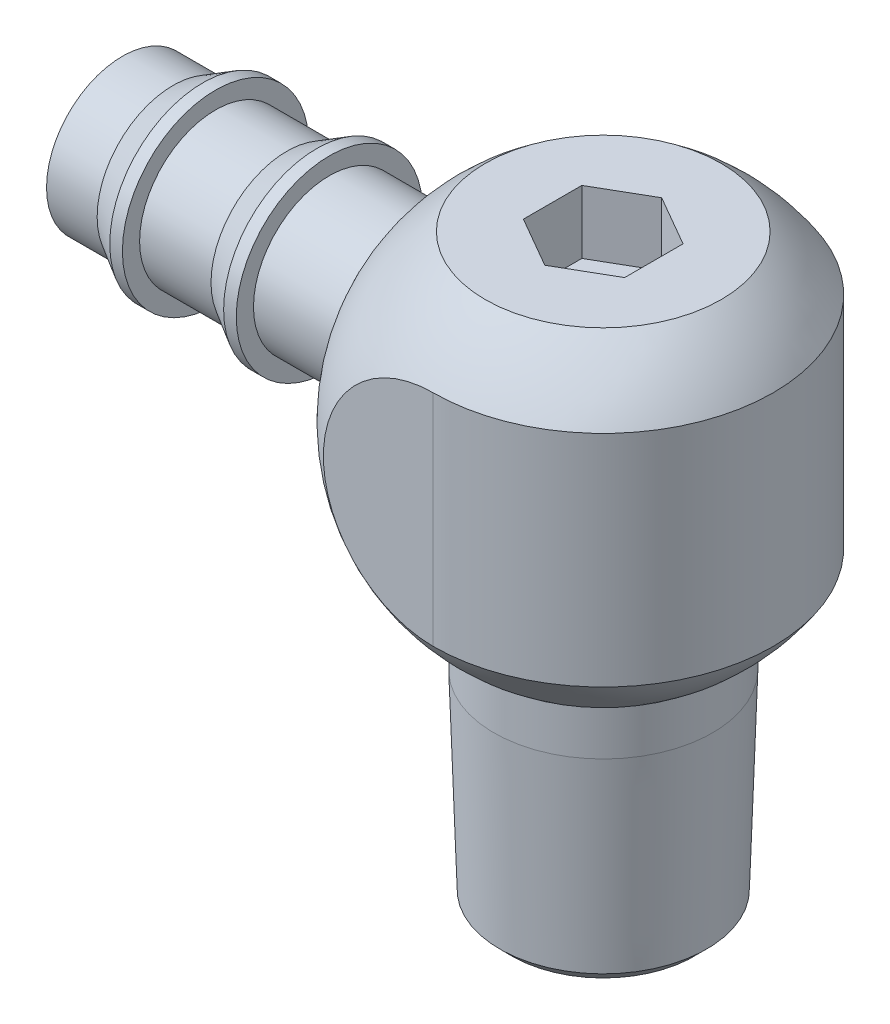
ISO-10303-21;
HEADER;
FILE_DESCRIPTION(('STEP AP214'),'2;1');
FILE_NAME('part.step','',(''),(''),'','','');
FILE_SCHEMA(('AUTOMOTIVE_DESIGN { 1 0 10303 214 1 1 1 1 }'));
ENDSEC;
DATA;
#1=APPLICATION_CONTEXT('core data for automotive mechanical design processes');
#2=APPLICATION_PROTOCOL_DEFINITION('international standard','automotive_design',2000,#1);
#3=PRODUCT_CONTEXT('',#1,'mechanical');
#4=PRODUCT('Part','Part','',(#3));
#5=PRODUCT_RELATED_PRODUCT_CATEGORY('part','',(#4));
#6=PRODUCT_DEFINITION_FORMATION('','',#4);
#7=PRODUCT_DEFINITION_CONTEXT('part definition',#1,'design');
#8=PRODUCT_DEFINITION('design','',#6,#7);
#9=PRODUCT_DEFINITION_SHAPE('','',#8);
#10=(LENGTH_UNIT() NAMED_UNIT(*) SI_UNIT(.MILLI.,.METRE.));
#11=(NAMED_UNIT(*) PLANE_ANGLE_UNIT() SI_UNIT($,.RADIAN.));
#12=(NAMED_UNIT(*) SI_UNIT($,.STERADIAN.) SOLID_ANGLE_UNIT());
#13=UNCERTAINTY_MEASURE_WITH_UNIT(LENGTH_MEASURE(1.E-05),#10,'distance_accuracy_value','');
#14=(GEOMETRIC_REPRESENTATION_CONTEXT(3) GLOBAL_UNCERTAINTY_ASSIGNED_CONTEXT((#13)) GLOBAL_UNIT_ASSIGNED_CONTEXT((#10,
#11,#12)) REPRESENTATION_CONTEXT('',''));
#15=CARTESIAN_POINT('',(0.,0.,0.));
#16=DIRECTION('',(0.,0.,1.));
#17=DIRECTION('',(1.,0.,0.));
#18=AXIS2_PLACEMENT_3D('',#15,#16,#17);
#19=CARTESIAN_POINT('',(-19.05,5.6642,-10.668));
#20=DIRECTION('',(0.,-1.,0.));
#21=DIRECTION('',(1.,0.,0.));
#22=AXIS2_PLACEMENT_3D('',#19,#20,#21);
#23=PLANE('',#22);
#24=CARTESIAN_POINT('',(0.,5.6642,0.));
#25=DIRECTION('',(0.,-1.,0.));
#26=DIRECTION('',(1.,0.,0.));
#27=AXIS2_PLACEMENT_3D('',#24,#25,#26);
#28=CIRCLE('',#27,7.40360712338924);
#29=CARTESIAN_POINT('',(7.40360712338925,5.6642,0.));
#30=VERTEX_POINT('',#29);
#31=EDGE_CURVE('E206',#30,#30,#28,.F.);
#32=ORIENTED_EDGE('',*,*,#31,.F.);
#33=EDGE_LOOP('',(#32));
#34=FACE_BOUND('',#33,.T.);
#35=CARTESIAN_POINT('',(0.,5.66419999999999,0.));
#36=DIRECTION('',(0.,1.,0.));
#37=DIRECTION('',(-1.,0.,0.));
#38=AXIS2_PLACEMENT_3D('',#35,#36,#37);
#39=CIRCLE('',#38,6.85799999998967);
#40=CARTESIAN_POINT('',(-6.85799999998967,5.66419999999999,0.));
#41=VERTEX_POINT('',#40);
#42=EDGE_CURVE('E167',#41,#41,#39,.T.);
#43=ORIENTED_EDGE('',*,*,#42,.T.);
#44=EDGE_LOOP('',(#43));
#45=FACE_BOUND('',#44,.T.);
#46=ADVANCED_FACE('F38',(#34,#45),#23,.T.);
#47=CARTESIAN_POINT('',(-10.668,3.28295,10.668));
#48=DIRECTION('',(1.,0.,0.));
#49=DIRECTION('',(0.,0.,-1.));
#50=AXIS2_PLACEMENT_3D('',#47,#48,#49);
#51=PLANE('',#50);
#52=CARTESIAN_POINT('',(-10.668,15.98295,0.));
#53=DIRECTION('',(1.,0.,0.));
#54=DIRECTION('',(0.,0.,-1.));
#55=AXIS2_PLACEMENT_3D('',#52,#53,#54);
#56=CIRCLE('',#55,5.953125);
#57=CARTESIAN_POINT('',(-10.668,15.98295,-5.953125));
#58=VERTEX_POINT('',#57);
#59=EDGE_CURVE('E12',#58,#58,#56,.T.);
#60=ORIENTED_EDGE('',*,*,#59,.T.);
#61=EDGE_LOOP('',(#60));
#62=FACE_BOUND('',#61,.T.);
#63=CARTESIAN_POINT('',(-10.668,15.98295,0.));
#64=DIRECTION('',(1.,0.,0.));
#65=DIRECTION('',(0.,0.,-1.));
#66=AXIS2_PLACEMENT_3D('',#63,#64,#65);
#67=CIRCLE('',#66,6.89084726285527);
#68=CARTESIAN_POINT('',(-10.668,15.98295,-6.89084726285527));
#69=VERTEX_POINT('',#68);
#70=EDGE_CURVE('E212',#69,#69,#67,.F.);
#71=ORIENTED_EDGE('',*,*,#70,.T.);
#72=EDGE_LOOP('',(#71));
#73=FACE_BOUND('',#72,.T.);
#74=ADVANCED_FACE('F247',(#62,#73),#51,.F.);
#75=CARTESIAN_POINT('',(0.,15.98295,0.));
#76=DIRECTION('',(0.,-1.,0.));
#77=DIRECTION('',(1.,0.,0.));
#78=AXIS2_PLACEMENT_3D('',#75,#76,#77);
#79=SPHERICAL_SURFACE('',#78,12.7);
#80=ORIENTED_EDGE('',*,*,#31,.T.);
#81=EDGE_LOOP('',(#80));
#82=FACE_BOUND('',#81,.T.);
#83=ORIENTED_EDGE('',*,*,#70,.F.);
#84=EDGE_LOOP('',(#83));
#85=FACE_BOUND('',#84,.T.);
#86=CARTESIAN_POINT('',(0.,15.98295,-10.668));
#87=DIRECTION('',(0.,0.,1.));
#88=DIRECTION('',(1.,0.,0.));
#89=AXIS2_PLACEMENT_3D('',#86,#87,#88);
#90=CIRCLE('',#89,6.89084726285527);
#91=CARTESIAN_POINT('',(0.,9.09210273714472,-10.668));
#92=VERTEX_POINT('',#91);
#93=CARTESIAN_POINT('',(0.,22.8737972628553,-10.668));
#94=VERTEX_POINT('',#93);
#95=EDGE_CURVE('E219',#92,#94,#90,.F.);
#96=ORIENTED_EDGE('',*,*,#95,.F.);
#97=CARTESIAN_POINT('',(0.,9.09210273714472,0.));
#98=DIRECTION('',(0.,1.,0.));
#99=DIRECTION('',(0.,0.,1.));
#100=AXIS2_PLACEMENT_3D('',#97,#98,#99);
#101=CIRCLE('',#100,10.668);
#102=CARTESIAN_POINT('',(0.,9.09210273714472,10.668));
#103=VERTEX_POINT('',#102);
#104=EDGE_CURVE('E217',#103,#92,#101,.T.);
#105=ORIENTED_EDGE('',*,*,#104,.F.);
#106=CARTESIAN_POINT('',(0.,15.98295,10.668));
#107=DIRECTION('',(0.,0.,-1.));
#108=DIRECTION('',(-1.,0.,0.));
#109=AXIS2_PLACEMENT_3D('',#106,#107,#108);
#110=CIRCLE('',#109,6.89084726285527);
#111=CARTESIAN_POINT('',(0.,22.8737972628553,10.668));
#112=VERTEX_POINT('',#111);
#113=EDGE_CURVE('E213',#112,#103,#110,.F.);
#114=ORIENTED_EDGE('',*,*,#113,.F.);
#115=CARTESIAN_POINT('',(0.,22.8737972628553,0.));
#116=DIRECTION('',(0.,-1.,0.));
#117=DIRECTION('',(0.,0.,-1.));
#118=AXIS2_PLACEMENT_3D('',#115,#116,#117);
#119=CIRCLE('',#118,10.668);
#120=EDGE_CURVE('E215',#94,#112,#119,.T.);
#121=ORIENTED_EDGE('',*,*,#120,.F.);
#122=EDGE_LOOP('',(#96,#105,#114,#121));
#123=FACE_BOUND('',#122,.T.);
#124=CARTESIAN_POINT('',(0.,26.3017,0.));
#125=DIRECTION('',(0.,1.,0.));
#126=DIRECTION('',(-1.,0.,0.));
#127=AXIS2_PLACEMENT_3D('',#124,#125,#126);
#128=CIRCLE('',#127,7.40360712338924);
#129=CARTESIAN_POINT('',(-7.40360712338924,26.3017,0.));
#130=VERTEX_POINT('',#129);
#131=EDGE_CURVE('E209',#130,#130,#128,.F.);
#132=ORIENTED_EDGE('',*,*,#131,.T.);
#133=EDGE_LOOP('',(#132));
#134=FACE_BOUND('',#133,.T.);
#135=ADVANCED_FACE('F253',(#82,#85,#123,#134),#79,.T.);
#136=CARTESIAN_POINT('',(0.,3.28295,-10.668));
#137=DIRECTION('',(0.,0.,1.));
#138=DIRECTION('',(1.,0.,0.));
#139=AXIS2_PLACEMENT_3D('',#136,#137,#138);
#140=PLANE('',#139);
#141=ORIENTED_EDGE('',*,*,#95,.T.);
#142=DIRECTION('',(0.,-1.,0.));
#143=VECTOR('',#142,1.);
#144=CARTESIAN_POINT('',(0.,3.28295,-10.668));
#145=LINE('',#144,#143);
#146=EDGE_CURVE('E208',#94,#92,#145,.T.);
#147=ORIENTED_EDGE('',*,*,#146,.T.);
#148=EDGE_LOOP('',(#141,#147));
#149=FACE_BOUND('',#148,.T.);
#150=ADVANCED_FACE('F265',(#149),#140,.F.);
#151=CARTESIAN_POINT('',(0.,3.28295,10.668));
#152=DIRECTION('',(0.,0.,-1.));
#153=DIRECTION('',(-1.,0.,0.));
#154=AXIS2_PLACEMENT_3D('',#151,#152,#153);
#155=PLANE('',#154);
#156=ORIENTED_EDGE('',*,*,#113,.T.);
#157=DIRECTION('',(0.,-1.,0.));
#158=VECTOR('',#157,1.);
#159=CARTESIAN_POINT('',(0.,3.28295,10.668));
#160=LINE('',#159,#158);
#161=EDGE_CURVE('E60',#112,#103,#160,.T.);
#162=ORIENTED_EDGE('',*,*,#161,.F.);
#163=EDGE_LOOP('',(#156,#162));
#164=FACE_BOUND('',#163,.T.);
#165=ADVANCED_FACE('F262',(#164),#155,.F.);
#166=CARTESIAN_POINT('',(0.,3.28295,0.));
#167=DIRECTION('',(0.,-1.,0.));
#168=DIRECTION('',(0.,0.,-1.));
#169=AXIS2_PLACEMENT_3D('',#166,#167,#168);
#170=CYLINDRICAL_SURFACE('',#169,10.668);
#171=ORIENTED_EDGE('',*,*,#104,.T.);
#172=ORIENTED_EDGE('',*,*,#146,.F.);
#173=ORIENTED_EDGE('',*,*,#120,.T.);
#174=ORIENTED_EDGE('',*,*,#161,.T.);
#175=EDGE_LOOP('',(#171,#172,#173,#174));
#176=FACE_BOUND('',#175,.T.);
#177=ADVANCED_FACE('F264',(#176),#170,.T.);
#178=CARTESIAN_POINT('',(-19.05,26.3017,-10.668));
#179=DIRECTION('',(0.,1.,0.));
#180=DIRECTION('',(-1.,0.,0.));
#181=AXIS2_PLACEMENT_3D('',#178,#179,#180);
#182=PLANE('',#181);
#183=DIRECTION('',(0.,0.,-1.));
#184=VECTOR('',#183,1.);
#185=CARTESIAN_POINT('',(3.175,26.3017,1.83308710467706));
#186=LINE('',#185,#184);
#187=CARTESIAN_POINT('',(3.175,26.3017,1.83308710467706));
#188=VERTEX_POINT('',#187);
#189=CARTESIAN_POINT('',(3.175,26.3017,-1.83308710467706));
#190=VERTEX_POINT('',#189);
#191=EDGE_CURVE('E53',#188,#190,#186,.T.);
#192=ORIENTED_EDGE('',*,*,#191,.F.);
#193=DIRECTION('',(0.866025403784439,0.,-0.5));
#194=VECTOR('',#193,1.);
#195=CARTESIAN_POINT('',(0.,26.3017,3.66617420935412));
#196=LINE('',#195,#194);
#197=CARTESIAN_POINT('',(0.,26.3017,3.66617420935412));
#198=VERTEX_POINT('',#197);
#199=EDGE_CURVE('E124',#198,#188,#196,.T.);
#200=ORIENTED_EDGE('',*,*,#199,.F.);
#201=DIRECTION('',(0.866025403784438,0.,0.5));
#202=VECTOR('',#201,1.);
#203=CARTESIAN_POINT('',(-3.175,26.3017,1.83308710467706));
#204=LINE('',#203,#202);
#205=CARTESIAN_POINT('',(-3.175,26.3017,1.83308710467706));
#206=VERTEX_POINT('',#205);
#207=EDGE_CURVE('E127',#206,#198,#204,.T.);
#208=ORIENTED_EDGE('',*,*,#207,.F.);
#209=DIRECTION('',(0.,0.,1.));
#210=VECTOR('',#209,1.);
#211=CARTESIAN_POINT('',(-3.175,26.3017,-1.83308710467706));
#212=LINE('',#211,#210);
#213=CARTESIAN_POINT('',(-3.175,26.3017,-1.83308710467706));
#214=VERTEX_POINT('',#213);
#215=EDGE_CURVE('E150',#214,#206,#212,.T.);
#216=ORIENTED_EDGE('',*,*,#215,.F.);
#217=DIRECTION('',(-0.866025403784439,0.,0.5));
#218=VECTOR('',#217,1.);
#219=CARTESIAN_POINT('',(0.,26.3017,-3.66617420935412));
#220=LINE('',#219,#218);
#221=CARTESIAN_POINT('',(0.,26.3017,-3.66617420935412));
#222=VERTEX_POINT('',#221);
#223=EDGE_CURVE('E147',#222,#214,#220,.T.);
#224=ORIENTED_EDGE('',*,*,#223,.F.);
#225=DIRECTION('',(-0.866025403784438,0.,-0.5));
#226=VECTOR('',#225,1.);
#227=CARTESIAN_POINT('',(3.175,26.3017,-1.83308710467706));
#228=LINE('',#227,#226);
#229=EDGE_CURVE('E145',#190,#222,#228,.T.);
#230=ORIENTED_EDGE('',*,*,#229,.F.);
#231=EDGE_LOOP('',(#192,#200,#208,#216,#224,#230));
#232=FACE_BOUND('',#231,.T.);
#233=ORIENTED_EDGE('',*,*,#131,.F.);
#234=EDGE_LOOP('',(#233));
#235=FACE_BOUND('',#234,.T.);
#236=ADVANCED_FACE('F260',(#232,#235),#182,.T.);
#237=CARTESIAN_POINT('',(0.,15.98295,0.));
#238=DIRECTION('',(-1.,0.,0.));
#239=DIRECTION('',(0.,0.,1.));
#240=AXIS2_PLACEMENT_3D('',#237,#238,#239);
#241=CYLINDRICAL_SURFACE('',#240,4.7625);
#242=CARTESIAN_POINT('',(-11.858625,15.98295,0.));
#243=DIRECTION('',(1.,0.,0.));
#244=DIRECTION('',(0.,0.,-1.));
#245=AXIS2_PLACEMENT_3D('',#242,#243,#244);
#246=CIRCLE('',#245,4.7625);
#247=CARTESIAN_POINT('',(-11.858625,15.98295,-4.7625));
#248=VERTEX_POINT('',#247);
#249=EDGE_CURVE('E46',#248,#248,#246,.F.);
#250=ORIENTED_EDGE('',*,*,#249,.T.);
#251=EDGE_LOOP('',(#250));
#252=FACE_BOUND('',#251,.T.);
#253=CARTESIAN_POINT('',(-17.1802511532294,15.98295,0.));
#254=DIRECTION('',(-1.,0.,0.));
#255=DIRECTION('',(0.,0.,1.));
#256=AXIS2_PLACEMENT_3D('',#253,#254,#255);
#257=CIRCLE('',#256,4.7625);
#258=CARTESIAN_POINT('',(-17.1802511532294,15.98295,4.7625));
#259=VERTEX_POINT('',#258);
#260=EDGE_CURVE('E182',#259,#259,#257,.T.);
#261=ORIENTED_EDGE('',*,*,#260,.F.);
#262=EDGE_LOOP('',(#261));
#263=FACE_BOUND('',#262,.T.);
#264=ADVANCED_FACE('F229',(#252,#263),#241,.T.);
#265=CARTESIAN_POINT('',(0.,15.98295,0.));
#266=DIRECTION('',(-1.,0.,0.));
#267=DIRECTION('',(0.,0.,1.));
#268=AXIS2_PLACEMENT_3D('',#265,#266,#267);
#269=CYLINDRICAL_SURFACE('',#268,4.7625);
#270=CARTESIAN_POINT('',(-30.1625,15.98295,0.));
#271=DIRECTION('',(-1.,0.,0.));
#272=DIRECTION('',(0.,0.,1.));
#273=AXIS2_PLACEMENT_3D('',#270,#271,#272);
#274=CIRCLE('',#273,4.7625);
#275=CARTESIAN_POINT('',(-30.1625,15.98295,4.7625));
#276=VERTEX_POINT('',#275);
#277=EDGE_CURVE('E179',#276,#276,#274,.T.);
#278=ORIENTED_EDGE('',*,*,#277,.F.);
#279=EDGE_LOOP('',(#278));
#280=FACE_BOUND('',#279,.T.);
#281=CARTESIAN_POINT('',(-26.9875,15.98295,0.));
#282=DIRECTION('',(-1.,0.,0.));
#283=DIRECTION('',(0.,0.,1.));
#284=AXIS2_PLACEMENT_3D('',#281,#282,#283);
#285=CIRCLE('',#284,4.7625);
#286=CARTESIAN_POINT('',(-26.9875,15.98295,4.7625));
#287=VERTEX_POINT('',#286);
#288=EDGE_CURVE('E203',#287,#287,#285,.T.);
#289=ORIENTED_EDGE('',*,*,#288,.T.);
#290=EDGE_LOOP('',(#289));
#291=FACE_BOUND('',#290,.T.);
#292=ADVANCED_FACE('F290',(#280,#291),#269,.T.);
#293=CARTESIAN_POINT('',(-25.1177511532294,15.98295,0.));
#294=DIRECTION('',(1.,0.,0.));
#295=DIRECTION('',(0.,0.,-1.));
#296=AXIS2_PLACEMENT_3D('',#293,#294,#295);
#297=CONICAL_SURFACE('',#296,5.842,0.523598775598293);
#298=ORIENTED_EDGE('',*,*,#288,.F.);
#299=EDGE_LOOP('',(#298));
#300=FACE_BOUND('',#299,.T.);
#301=CARTESIAN_POINT('',(-25.1177511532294,15.98295,0.));
#302=DIRECTION('',(-1.,0.,0.));
#303=DIRECTION('',(0.,0.,1.));
#304=AXIS2_PLACEMENT_3D('',#301,#302,#303);
#305=CIRCLE('',#304,5.842);
#306=CARTESIAN_POINT('',(-25.1177511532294,15.98295,5.842));
#307=VERTEX_POINT('',#306);
#308=EDGE_CURVE('E200',#307,#307,#305,.T.);
#309=ORIENTED_EDGE('',*,*,#308,.T.);
#310=EDGE_LOOP('',(#309));
#311=FACE_BOUND('',#310,.T.);
#312=ADVANCED_FACE('F360',(#300,#311),#297,.T.);
#313=CARTESIAN_POINT('',(0.,15.98295,0.));
#314=DIRECTION('',(-1.,0.,0.));
#315=DIRECTION('',(0.,0.,1.));
#316=AXIS2_PLACEMENT_3D('',#313,#314,#315);
#317=CYLINDRICAL_SURFACE('',#316,5.842);
#318=ORIENTED_EDGE('',*,*,#308,.F.);
#319=EDGE_LOOP('',(#318));
#320=FACE_BOUND('',#319,.T.);
#321=CARTESIAN_POINT('',(-24.3240011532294,15.98295,0.));
#322=DIRECTION('',(-1.,0.,0.));
#323=DIRECTION('',(0.,0.,1.));
#324=AXIS2_PLACEMENT_3D('',#321,#322,#323);
#325=CIRCLE('',#324,5.842);
#326=CARTESIAN_POINT('',(-24.3240011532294,15.98295,5.842));
#327=VERTEX_POINT('',#326);
#328=EDGE_CURVE('E197',#327,#327,#325,.T.);
#329=ORIENTED_EDGE('',*,*,#328,.T.);
#330=EDGE_LOOP('',(#329));
#331=FACE_BOUND('',#330,.T.);
#332=ADVANCED_FACE('F356',(#320,#331),#317,.T.);
#333=CARTESIAN_POINT('',(-24.3240011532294,15.98295,-5.842));
#334=DIRECTION('',(-1.,0.,0.));
#335=DIRECTION('',(0.,0.,1.));
#336=AXIS2_PLACEMENT_3D('',#333,#334,#335);
#337=PLANE('',#336);
#338=ORIENTED_EDGE('',*,*,#328,.F.);
#339=EDGE_LOOP('',(#338));
#340=FACE_BOUND('',#339,.T.);
#341=CARTESIAN_POINT('',(-24.3240011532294,15.98295,0.));
#342=DIRECTION('',(-1.,0.,0.));
#343=DIRECTION('',(0.,0.,1.));
#344=AXIS2_PLACEMENT_3D('',#341,#342,#343);
#345=CIRCLE('',#344,4.7625);
#346=CARTESIAN_POINT('',(-24.3240011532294,15.98295,4.7625));
#347=VERTEX_POINT('',#346);
#348=EDGE_CURVE('E194',#347,#347,#345,.T.);
#349=ORIENTED_EDGE('',*,*,#348,.T.);
#350=EDGE_LOOP('',(#349));
#351=FACE_BOUND('',#350,.T.);
#352=ADVANCED_FACE('F352',(#340,#351),#337,.F.);
#353=CARTESIAN_POINT('',(0.,15.98295,0.));
#354=DIRECTION('',(-1.,0.,0.));
#355=DIRECTION('',(0.,0.,1.));
#356=AXIS2_PLACEMENT_3D('',#353,#354,#355);
#357=CYLINDRICAL_SURFACE('',#356,4.7625);
#358=ORIENTED_EDGE('',*,*,#348,.F.);
#359=EDGE_LOOP('',(#358));
#360=FACE_BOUND('',#359,.T.);
#361=CARTESIAN_POINT('',(-19.84375,15.98295,0.));
#362=DIRECTION('',(-1.,0.,0.));
#363=DIRECTION('',(0.,0.,1.));
#364=AXIS2_PLACEMENT_3D('',#361,#362,#363);
#365=CIRCLE('',#364,4.7625);
#366=CARTESIAN_POINT('',(-19.84375,15.98295,4.7625));
#367=VERTEX_POINT('',#366);
#368=EDGE_CURVE('E191',#367,#367,#365,.T.);
#369=ORIENTED_EDGE('',*,*,#368,.T.);
#370=EDGE_LOOP('',(#369));
#371=FACE_BOUND('',#370,.T.);
#372=ADVANCED_FACE('F348',(#360,#371),#357,.T.);
#373=CARTESIAN_POINT('',(-17.9740011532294,15.98295,0.));
#374=DIRECTION('',(1.,0.,0.));
#375=DIRECTION('',(0.,0.,-1.));
#376=AXIS2_PLACEMENT_3D('',#373,#374,#375);
#377=CONICAL_SURFACE('',#376,5.842,0.523598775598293);
#378=ORIENTED_EDGE('',*,*,#368,.F.);
#379=EDGE_LOOP('',(#378));
#380=FACE_BOUND('',#379,.T.);
#381=CARTESIAN_POINT('',(-17.9740011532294,15.98295,0.));
#382=DIRECTION('',(-1.,0.,0.));
#383=DIRECTION('',(0.,0.,1.));
#384=AXIS2_PLACEMENT_3D('',#381,#382,#383);
#385=CIRCLE('',#384,5.842);
#386=CARTESIAN_POINT('',(-17.9740011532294,15.98295,5.842));
#387=VERTEX_POINT('',#386);
#388=EDGE_CURVE('E188',#387,#387,#385,.T.);
#389=ORIENTED_EDGE('',*,*,#388,.T.);
#390=EDGE_LOOP('',(#389));
#391=FACE_BOUND('',#390,.T.);
#392=ADVANCED_FACE('F344',(#380,#391),#377,.T.);
#393=CARTESIAN_POINT('',(0.,15.98295,0.));
#394=DIRECTION('',(-1.,0.,0.));
#395=DIRECTION('',(0.,0.,1.));
#396=AXIS2_PLACEMENT_3D('',#393,#394,#395);
#397=CYLINDRICAL_SURFACE('',#396,5.842);
#398=ORIENTED_EDGE('',*,*,#388,.F.);
#399=EDGE_LOOP('',(#398));
#400=FACE_BOUND('',#399,.T.);
#401=CARTESIAN_POINT('',(-17.1802511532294,15.98295,0.));
#402=DIRECTION('',(-1.,0.,0.));
#403=DIRECTION('',(0.,0.,1.));
#404=AXIS2_PLACEMENT_3D('',#401,#402,#403);
#405=CIRCLE('',#404,5.842);
#406=CARTESIAN_POINT('',(-17.1802511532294,15.98295,5.842));
#407=VERTEX_POINT('',#406);
#408=EDGE_CURVE('E185',#407,#407,#405,.T.);
#409=ORIENTED_EDGE('',*,*,#408,.T.);
#410=EDGE_LOOP('',(#409));
#411=FACE_BOUND('',#410,.T.);
#412=ADVANCED_FACE('F340',(#400,#411),#397,.T.);
#413=CARTESIAN_POINT('',(-17.1802511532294,15.98295,-5.842));
#414=DIRECTION('',(-1.,0.,0.));
#415=DIRECTION('',(0.,0.,1.));
#416=AXIS2_PLACEMENT_3D('',#413,#414,#415);
#417=PLANE('',#416);
#418=ORIENTED_EDGE('',*,*,#408,.F.);
#419=EDGE_LOOP('',(#418));
#420=FACE_BOUND('',#419,.T.);
#421=ORIENTED_EDGE('',*,*,#260,.T.);
#422=EDGE_LOOP('',(#421));
#423=FACE_BOUND('',#422,.T.);
#424=ADVANCED_FACE('F242',(#420,#423),#417,.F.);
#425=CARTESIAN_POINT('',(-30.1625,15.98295,0.));
#426=DIRECTION('',(1.,0.,0.));
#427=DIRECTION('',(0.,0.,-1.));
#428=AXIS2_PLACEMENT_3D('',#425,#426,#427);
#429=PLANE('',#428);
#430=CARTESIAN_POINT('',(-30.1625,15.98295,0.));
#431=DIRECTION('',(-1.,0.,0.));
#432=DIRECTION('',(0.,0.,1.));
#433=AXIS2_PLACEMENT_3D('',#430,#431,#432);
#434=CIRCLE('',#433,3.4925);
#435=CARTESIAN_POINT('',(-30.1625,15.98295,3.4925));
#436=VERTEX_POINT('',#435);
#437=EDGE_CURVE('E176',#436,#436,#434,.T.);
#438=ORIENTED_EDGE('',*,*,#437,.F.);
#439=EDGE_LOOP('',(#438));
#440=FACE_BOUND('',#439,.T.);
#441=ORIENTED_EDGE('',*,*,#277,.T.);
#442=EDGE_LOOP('',(#441));
#443=FACE_BOUND('',#442,.T.);
#444=ADVANCED_FACE('F234',(#440,#443),#429,.F.);
#445=CARTESIAN_POINT('',(-11.858625,15.98295,0.));
#446=DIRECTION('',(1.,0.,0.));
#447=DIRECTION('',(0.,0.,-1.));
#448=AXIS2_PLACEMENT_3D('',#445,#446,#447);
#449=TOROIDAL_SURFACE('',#448,5.953125,1.190625);
#450=ORIENTED_EDGE('',*,*,#59,.F.);
#451=EDGE_LOOP('',(#450));
#452=FACE_BOUND('',#451,.T.);
#453=ORIENTED_EDGE('',*,*,#249,.F.);
#454=EDGE_LOOP('',(#453));
#455=FACE_BOUND('',#454,.T.);
#456=ADVANCED_FACE('F40',(#452,#455),#449,.F.);
#457=CARTESIAN_POINT('',(9.87828173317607,15.98295,0.));
#458=DIRECTION('',(-1.,0.,0.));
#459=DIRECTION('',(0.,0.,1.));
#460=AXIS2_PLACEMENT_3D('',#457,#458,#459);
#461=CYLINDRICAL_SURFACE('',#460,3.4925);
#462=CARTESIAN_POINT('',(-3.23787739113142,15.98295,3.4925));
#463=CARTESIAN_POINT('',(-3.23787574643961,15.9006540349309,3.49250095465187));
#464=CARTESIAN_POINT('',(-3.24103033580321,15.8183648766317,3.4895846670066));
#465=CARTESIAN_POINT('',(-3.25345666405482,15.6546240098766,3.47800197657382));
#466=CARTESIAN_POINT('',(-3.26273142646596,15.573172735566,3.46933273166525));
#467=CARTESIAN_POINT('',(-3.28690649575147,15.4117293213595,3.4464367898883));
#468=CARTESIAN_POINT('',(-3.30181917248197,15.3317407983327,3.43219787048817));
#469=CARTESIAN_POINT('',(-3.33652658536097,15.1739419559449,3.39846758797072));
#470=CARTESIAN_POINT('',(-3.35632424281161,15.0961329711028,3.37897308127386));
#471=CARTESIAN_POINT('',(-3.42118356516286,14.8686944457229,3.31370243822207));
#472=CARTESIAN_POINT('',(-3.47210346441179,14.7227311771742,3.26079327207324));
#473=CARTESIAN_POINT('',(-3.58341103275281,14.4422966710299,3.13806132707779));
#474=CARTESIAN_POINT('',(-3.64379804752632,14.3078246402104,3.06823971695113));
#475=CARTESIAN_POINT('',(-3.78139961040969,14.0250801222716,2.89770102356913));
#476=CARTESIAN_POINT('',(-3.85958419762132,13.8793156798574,2.79360655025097));
#477=CARTESIAN_POINT('',(-4.01569902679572,13.6049902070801,2.56414850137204));
#478=CARTESIAN_POINT('',(-4.09362876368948,13.4764533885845,2.43875554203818));
#479=CARTESIAN_POINT('',(-4.21312256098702,13.2867402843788,2.22250847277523));
#480=CARTESIAN_POINT('',(-4.25666537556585,13.2193208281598,2.13815073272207));
#481=CARTESIAN_POINT('',(-4.34045231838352,13.0919321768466,1.96248243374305));
#482=CARTESIAN_POINT('',(-4.38069795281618,13.0319595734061,1.87117508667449));
#483=CARTESIAN_POINT('',(-4.45672144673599,12.9202409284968,1.68208305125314));
#484=CARTESIAN_POINT('',(-4.49250579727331,12.8684829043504,1.58430809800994));
#485=CARTESIAN_POINT('',(-4.55856277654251,12.7739336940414,1.38280879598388));
#486=CARTESIAN_POINT('',(-4.58883813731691,12.7311380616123,1.27908742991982));
#487=CARTESIAN_POINT('',(-4.65414554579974,12.6394999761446,1.02198440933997));
#488=CARTESIAN_POINT('',(-4.68589117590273,12.5955855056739,0.865940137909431));
#489=CARTESIAN_POINT('',(-4.7337194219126,12.5297250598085,0.547057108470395));
#490=CARTESIAN_POINT('',(-4.7498153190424,12.5077604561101,0.384224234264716));
#491=CARTESIAN_POINT('',(-4.76501199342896,12.4870177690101,0.0558737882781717));
#492=CARTESIAN_POINT('',(-4.76407247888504,12.4882946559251,-0.109649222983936));
#493=CARTESIAN_POINT('',(-4.7451770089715,12.5140986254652,-0.437889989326));
#494=CARTESIAN_POINT('',(-4.72721678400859,12.5386315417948,-0.600607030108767));
#495=CARTESIAN_POINT('',(-4.67663048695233,12.6084016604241,-0.913758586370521));
#496=CARTESIAN_POINT('',(-4.64446581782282,12.652988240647,-1.06441595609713));
#497=CARTESIAN_POINT('',(-4.56796317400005,12.760549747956,-1.35566195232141));
#498=CARTESIAN_POINT('',(-4.52362267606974,12.8235284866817,-1.49624848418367));
#499=CARTESIAN_POINT('',(-4.42013192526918,12.9734671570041,-1.78020188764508));
#500=CARTESIAN_POINT('',(-4.35988897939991,13.0623032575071,-1.92217271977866));
#501=CARTESIAN_POINT('',(-4.23176072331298,13.2572665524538,-2.18990467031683));
#502=CARTESIAN_POINT('',(-4.16386826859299,13.3634099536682,-2.31565039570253));
#503=CARTESIAN_POINT('',(-4.01118991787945,13.6128511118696,-2.57257203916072));
#504=CARTESIAN_POINT('',(-3.92565795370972,13.7593716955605,-2.70017994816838));
#505=CARTESIAN_POINT('',(-3.75713602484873,14.0725322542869,-2.93012214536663));
#506=CARTESIAN_POINT('',(-3.67414665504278,14.2391768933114,-3.03245055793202));
#507=CARTESIAN_POINT('',(-3.53685230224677,14.5542998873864,-3.19070979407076));
#508=CARTESIAN_POINT('',(-3.48019979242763,14.6991102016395,-3.25187952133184));
#509=CARTESIAN_POINT('',(-3.38087443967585,14.9998667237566,-3.35503240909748));
#510=CARTESIAN_POINT('',(-3.33817016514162,15.155786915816,-3.39705879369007));
#511=CARTESIAN_POINT('',(-3.27911773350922,15.448551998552,-3.45401224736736));
#512=CARTESIAN_POINT('',(-3.25949455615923,15.5840498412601,-3.47236265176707));
#513=CARTESIAN_POINT('',(-3.23744512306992,15.8576123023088,-3.49293703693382));
#514=CARTESIAN_POINT('',(-3.23500237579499,15.9956743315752,-3.49517648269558));
#515=CARTESIAN_POINT('',(-3.24769267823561,16.2701175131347,-3.48338281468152));
#516=CARTESIAN_POINT('',(-3.26281055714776,16.4065000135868,-3.46936374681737));
#517=CARTESIAN_POINT('',(-3.30821474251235,16.6742873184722,-3.42608775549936));
#518=CARTESIAN_POINT('',(-3.33852508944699,16.8056838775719,-3.39680667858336));
#519=CARTESIAN_POINT('',(-3.42483095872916,17.1121389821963,-3.31013169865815));
#520=CARTESIAN_POINT('',(-3.48624709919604,17.2837922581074,-3.24618958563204));
#521=CARTESIAN_POINT('',(-3.62119007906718,17.611316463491,-3.09494294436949));
#522=CARTESIAN_POINT('',(-3.69474120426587,17.7671547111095,-3.0075913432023));
#523=CARTESIAN_POINT('',(-3.84843797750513,18.0670995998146,-2.80842873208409));
#524=CARTESIAN_POINT('',(-3.92871853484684,18.2106802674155,-2.69593234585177));
#525=CARTESIAN_POINT('',(-4.08698884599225,18.479218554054,-2.44936261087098));
#526=CARTESIAN_POINT('',(-4.16498031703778,18.6041904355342,-2.31530595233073));
#527=CARTESIAN_POINT('',(-4.31101468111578,18.8304477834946,-2.03016864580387));
#528=CARTESIAN_POINT('',(-4.37926095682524,18.9322571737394,-1.87961091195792));
#529=CARTESIAN_POINT('',(-4.50292722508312,19.1129410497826,-1.56020858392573));
#530=CARTESIAN_POINT('',(-4.55835000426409,19.1918205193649,-1.3913679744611));
#531=CARTESIAN_POINT('',(-4.62829990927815,19.2901892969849,-1.12639066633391));
#532=CARTESIAN_POINT('',(-4.64949140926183,19.319750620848,-1.03562899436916));
#533=CARTESIAN_POINT('',(-4.68678858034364,19.3715284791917,-0.851034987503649));
#534=CARTESIAN_POINT('',(-4.70289700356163,19.3937489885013,-0.757204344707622));
#535=CARTESIAN_POINT('',(-4.72955915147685,19.4304182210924,-0.567331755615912));
#536=CARTESIAN_POINT('',(-4.74011687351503,19.4448725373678,-0.471291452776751));
#537=CARTESIAN_POINT('',(-4.7553747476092,19.4657348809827,-0.277884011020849));
#538=CARTESIAN_POINT('',(-4.76007592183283,19.4721443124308,-0.180517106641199));
#539=CARTESIAN_POINT('',(-4.76322226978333,19.4764349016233,-0.000114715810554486));
#540=CARTESIAN_POINT('',(-4.76249924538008,19.4754499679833,0.0828822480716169));
#541=CARTESIAN_POINT('',(-4.75673542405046,19.4675861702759,0.248473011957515));
#542=CARTESIAN_POINT('',(-4.75169331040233,19.4607055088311,0.331066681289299));
#543=CARTESIAN_POINT('',(-4.73740392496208,19.4411563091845,0.495164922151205));
#544=CARTESIAN_POINT('',(-4.72815830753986,19.4284900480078,0.576669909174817));
#545=CARTESIAN_POINT('',(-4.70566945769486,19.3975634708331,0.738061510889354));
#546=CARTESIAN_POINT('',(-4.69242466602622,19.3793009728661,0.817947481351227));
#547=CARTESIAN_POINT('',(-4.64796968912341,19.3177037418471,1.04974765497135));
#548=CARTESIAN_POINT('',(-4.61157539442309,19.2669382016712,1.19877819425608));
#549=CARTESIAN_POINT('',(-4.5272787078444,19.1474697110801,1.48580198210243));
#550=CARTESIAN_POINT('',(-4.47937448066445,19.0787638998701,1.62379346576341));
#551=CARTESIAN_POINT('',(-4.36819246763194,18.9157427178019,1.90416795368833));
#552=CARTESIAN_POINT('',(-4.30372862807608,18.8192669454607,2.04482074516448));
#553=CARTESIAN_POINT('',(-4.16805500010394,18.60884120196,2.30885669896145));
#554=CARTESIAN_POINT('',(-4.09683673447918,18.4948691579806,2.43221766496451));
#555=CARTESIAN_POINT('',(-3.93818988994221,18.2277779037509,2.6829202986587));
#556=CARTESIAN_POINT('',(-3.85028357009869,18.0713477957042,2.80644275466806));
#557=CARTESIAN_POINT('',(-3.679958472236,17.7376167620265,3.02631644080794));
#558=CARTESIAN_POINT('',(-3.59753729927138,17.5603250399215,3.12267958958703));
#559=CARTESIAN_POINT('',(-3.47074274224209,17.2388777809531,3.2621443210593));
#560=CARTESIAN_POINT('',(-3.42220579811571,17.0995666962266,3.31260085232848));
#561=CARTESIAN_POINT('',(-3.33949406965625,16.8118888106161,3.39597870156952));
#562=CARTESIAN_POINT('',(-3.30527509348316,16.6635515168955,3.42895405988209));
#563=CARTESIAN_POINT('',(-3.26683604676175,16.4253931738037,3.46547921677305));
#564=CARTESIAN_POINT('',(-3.25604608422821,16.337586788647,3.47558051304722));
#565=CARTESIAN_POINT('',(-3.24156723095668,16.1608343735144,3.48909077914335));
#566=CARTESIAN_POINT('',(-3.23787916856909,16.0718882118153,3.49249896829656));
#567=CARTESIAN_POINT('',(-3.23787739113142,15.98295,3.4925));
#568=B_SPLINE_CURVE_WITH_KNOTS('',3,(#462,#463,#464,#465,#466,#467,#468,#469,#470,#471,#472,
#473,#474,#475,#476,#477,#478,#479,#480,#481,#482,#483,#484,#485,#486,#487,#488,#489,#490,#491,
#492,#493,#494,#495,#496,#497,#498,#499,#500,#501,#502,#503,#504,#505,#506,#507,#508,#509,#510,
#511,#512,#513,#514,#515,#516,#517,#518,#519,#520,#521,#522,#523,#524,#525,#526,#527,#528,#529,
#530,#531,#532,#533,#534,#535,#536,#537,#538,#539,#540,#541,#542,#543,#544,#545,#546,#547,#548,
#549,#550,#551,#552,#553,#554,#555,#556,#557,#558,#559,#560,#561,#562,#563,#564,#565,#566,#567),
.UNSPECIFIED.,.T.,.F.,(4,2,2,2,2,2,2,2,2,2,2,2,2,2,2,2,2,2,2,2,2,2,2,2,2,2,2,2,2,2,2,2,2,2,2,2,
2,2,2,2,2,2,2,2,2,2,2,2,2,2,2,2,4),(0.,0.246766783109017,0.493655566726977,0.741089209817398,
0.988671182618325,1.47678799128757,1.96487107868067,2.54920623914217,3.13435420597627,
3.48324329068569,3.83197209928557,4.18018744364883,4.52822962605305,5.0214971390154,
5.51434567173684,6.00836003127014,6.50249834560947,6.98164737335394,7.46089577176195,
7.99287476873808,8.52535480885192,9.15976130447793,9.79431511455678,10.2939861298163,
10.7925232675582,11.2050923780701,11.6172654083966,12.0290826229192,12.4415535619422,
13.0179778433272,13.5955700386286,14.1914045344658,14.7867799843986,15.3669326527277,
15.9469591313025,16.2399137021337,16.5327093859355,16.8252939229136,17.1178273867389,
17.3665304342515,17.6153093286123,17.86399039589,18.1127685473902,18.595407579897,
19.0781236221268,19.6231162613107,20.168802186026,20.8197105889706,21.4703328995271,
21.9366078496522,22.4014328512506,22.6680854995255,22.9347692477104),.UNSPECIFIED.);
#569=CARTESIAN_POINT('',(-3.23787739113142,15.98295,3.4925));
#570=VERTEX_POINT('',#569);
#571=EDGE_CURVE('E130',#570,#570,#568,.T.);
#572=ORIENTED_EDGE('',*,*,#571,.T.);
#573=EDGE_LOOP('',(#572));
#574=FACE_BOUND('',#573,.T.);
#575=ORIENTED_EDGE('',*,*,#437,.T.);
#576=EDGE_LOOP('',(#575));
#577=FACE_BOUND('',#576,.T.);
#578=ADVANCED_FACE('F233',(#574,#577),#461,.F.);
#579=CARTESIAN_POINT('',(0.,-10.2108,0.));
#580=DIRECTION('',(0.,1.,0.));
#581=DIRECTION('',(-1.,0.,0.));
#582=AXIS2_PLACEMENT_3D('',#579,#580,#581);
#583=CONICAL_SURFACE('',#582,5.72293971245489,0.785398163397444);
#584=CARTESIAN_POINT('',(0.,-9.44880000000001,0.));
#585=DIRECTION('',(0.,1.,0.));
#586=DIRECTION('',(-1.,0.,0.));
#587=AXIS2_PLACEMENT_3D('',#584,#585,#586);
#588=CIRCLE('',#587,6.48493971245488);
#589=CARTESIAN_POINT('',(-6.48493971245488,-9.44880000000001,0.));
#590=VERTEX_POINT('',#589);
#591=EDGE_CURVE('E173',#590,#590,#588,.T.);
#592=ORIENTED_EDGE('',*,*,#591,.F.);
#593=EDGE_LOOP('',(#592));
#594=FACE_BOUND('',#593,.T.);
#595=CARTESIAN_POINT('',(0.,-10.2108,0.));
#596=DIRECTION('',(0.,1.,0.));
#597=DIRECTION('',(-1.,0.,0.));
#598=AXIS2_PLACEMENT_3D('',#595,#596,#597);
#599=CIRCLE('',#598,5.72293971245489);
#600=CARTESIAN_POINT('',(-5.72293971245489,-10.2108,0.));
#601=VERTEX_POINT('',#600);
#602=EDGE_CURVE('E157',#601,#601,#599,.T.);
#603=ORIENTED_EDGE('',*,*,#602,.T.);
#604=EDGE_LOOP('',(#603));
#605=FACE_BOUND('',#604,.T.);
#606=ADVANCED_FACE('F240',(#594,#605),#583,.T.);
#607=CARTESIAN_POINT('',(0.,-9.44880000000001,0.));
#608=DIRECTION('',(0.,1.,0.));
#609=DIRECTION('',(-1.,0.,0.));
#610=AXIS2_PLACEMENT_3D('',#607,#608,#609);
#611=CONICAL_SURFACE('',#610,6.48493971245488,0.0312396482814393);
#612=CARTESIAN_POINT('',(0.,2.48919999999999,0.));
#613=DIRECTION('',(0.,1.,0.));
#614=DIRECTION('',(-1.,0.,0.));
#615=AXIS2_PLACEMENT_3D('',#612,#613,#614);
#616=CIRCLE('',#615,6.85799999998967);
#617=CARTESIAN_POINT('',(-6.85799999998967,2.48919999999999,0.));
#618=VERTEX_POINT('',#617);
#619=EDGE_CURVE('E170',#618,#618,#616,.T.);
#620=ORIENTED_EDGE('',*,*,#619,.F.);
#621=EDGE_LOOP('',(#620));
#622=FACE_BOUND('',#621,.T.);
#623=ORIENTED_EDGE('',*,*,#591,.T.);
#624=EDGE_LOOP('',(#623));
#625=FACE_BOUND('',#624,.T.);
#626=ADVANCED_FACE('F329',(#622,#625),#611,.T.);
#627=CARTESIAN_POINT('',(0.,-11.0195942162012,0.));
#628=DIRECTION('',(0.,1.,0.));
#629=DIRECTION('',(-1.,0.,0.));
#630=AXIS2_PLACEMENT_3D('',#627,#628,#629);
#631=CYLINDRICAL_SURFACE('',#630,6.85799999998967);
#632=ORIENTED_EDGE('',*,*,#42,.F.);
#633=EDGE_LOOP('',(#632));
#634=FACE_BOUND('',#633,.T.);
#635=ORIENTED_EDGE('',*,*,#619,.T.);
#636=EDGE_LOOP('',(#635));
#637=FACE_BOUND('',#636,.T.);
#638=ADVANCED_FACE('F325',(#634,#637),#631,.T.);
#639=CARTESIAN_POINT('',(0.,-10.2108,0.));
#640=DIRECTION('',(0.,1.,0.));
#641=DIRECTION('',(-1.,0.,0.));
#642=AXIS2_PLACEMENT_3D('',#639,#640,#641);
#643=PLANE('',#642);
#644=CARTESIAN_POINT('',(0.,-10.2108,0.));
#645=DIRECTION('',(0.,-1.,0.));
#646=DIRECTION('',(1.,0.,0.));
#647=AXIS2_PLACEMENT_3D('',#644,#645,#646);
#648=CIRCLE('',#647,4.7625);
#649=CARTESIAN_POINT('',(4.76249999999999,-10.2108,0.));
#650=VERTEX_POINT('',#649);
#651=EDGE_CURVE('E611',#650,#650,#648,.T.);
#652=ORIENTED_EDGE('',*,*,#651,.F.);
#653=EDGE_LOOP('',(#652));
#654=FACE_BOUND('',#653,.T.);
#655=ORIENTED_EDGE('',*,*,#602,.F.);
#656=EDGE_LOOP('',(#655));
#657=FACE_BOUND('',#656,.T.);
#658=ADVANCED_FACE('F313',(#654,#657),#643,.F.);
#659=CARTESIAN_POINT('',(3.175,22.33295,1.83308710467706));
#660=DIRECTION('',(1.,0.,0.));
#661=DIRECTION('',(0.,0.,-1.));
#662=AXIS2_PLACEMENT_3D('',#659,#660,#661);
#663=PLANE('',#662);
#664=ORIENTED_EDGE('',*,*,#191,.T.);
#665=DIRECTION('',(0.,1.,0.));
#666=VECTOR('',#665,1.);
#667=CARTESIAN_POINT('',(3.175,22.33295,-1.83308710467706));
#668=LINE('',#667,#666);
#669=CARTESIAN_POINT('',(3.175,22.33295,-1.83308710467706));
#670=VERTEX_POINT('',#669);
#671=EDGE_CURVE('E101',#670,#190,#668,.T.);
#672=ORIENTED_EDGE('',*,*,#671,.F.);
#673=DIRECTION('',(0.,0.,-1.));
#674=VECTOR('',#673,1.);
#675=CARTESIAN_POINT('',(3.175,22.33295,1.83308710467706));
#676=LINE('',#675,#674);
#677=CARTESIAN_POINT('',(3.175,22.33295,1.83308710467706));
#678=VERTEX_POINT('',#677);
#679=EDGE_CURVE('E105',#678,#670,#676,.T.);
#680=ORIENTED_EDGE('',*,*,#679,.F.);
#681=DIRECTION('',(0.,1.,0.));
#682=VECTOR('',#681,1.);
#683=CARTESIAN_POINT('',(3.175,22.33295,1.83308710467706));
#684=LINE('',#683,#682);
#685=EDGE_CURVE('E155',#678,#188,#684,.T.);
#686=ORIENTED_EDGE('',*,*,#685,.T.);
#687=EDGE_LOOP('',(#664,#672,#680,#686));
#688=FACE_BOUND('',#687,.T.);
#689=ADVANCED_FACE('F103',(#688),#663,.F.);
#690=CARTESIAN_POINT('',(0.,22.33295,3.66617420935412));
#691=DIRECTION('',(0.5,0.,0.866025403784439));
#692=DIRECTION('',(0.866025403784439,0.,-0.5));
#693=AXIS2_PLACEMENT_3D('',#690,#691,#692);
#694=PLANE('',#693);
#695=ORIENTED_EDGE('',*,*,#199,.T.);
#696=ORIENTED_EDGE('',*,*,#685,.F.);
#697=DIRECTION('',(0.866025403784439,0.,-0.5));
#698=VECTOR('',#697,1.);
#699=CARTESIAN_POINT('',(0.,22.33295,3.66617420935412));
#700=LINE('',#699,#698);
#701=CARTESIAN_POINT('',(0.,22.33295,3.66617420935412));
#702=VERTEX_POINT('',#701);
#703=EDGE_CURVE('E111',#702,#678,#700,.T.);
#704=ORIENTED_EDGE('',*,*,#703,.F.);
#705=DIRECTION('',(0.,1.,0.));
#706=VECTOR('',#705,1.);
#707=CARTESIAN_POINT('',(0.,22.33295,3.66617420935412));
#708=LINE('',#707,#706);
#709=EDGE_CURVE('E158',#702,#198,#708,.T.);
#710=ORIENTED_EDGE('',*,*,#709,.T.);
#711=EDGE_LOOP('',(#695,#696,#704,#710));
#712=FACE_BOUND('',#711,.T.);
#713=ADVANCED_FACE('F305',(#712),#694,.F.);
#714=CARTESIAN_POINT('',(-3.175,22.33295,1.83308710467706));
#715=DIRECTION('',(-0.5,0.,0.866025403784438));
#716=DIRECTION('',(0.866025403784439,0.,0.5));
#717=AXIS2_PLACEMENT_3D('',#714,#715,#716);
#718=PLANE('',#717);
#719=ORIENTED_EDGE('',*,*,#207,.T.);
#720=ORIENTED_EDGE('',*,*,#709,.F.);
#721=DIRECTION('',(0.866025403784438,0.,0.5));
#722=VECTOR('',#721,1.);
#723=CARTESIAN_POINT('',(-3.175,22.33295,1.83308710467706));
#724=LINE('',#723,#722);
#725=CARTESIAN_POINT('',(-3.175,22.33295,1.83308710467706));
#726=VERTEX_POINT('',#725);
#727=EDGE_CURVE('E141',#726,#702,#724,.T.);
#728=ORIENTED_EDGE('',*,*,#727,.F.);
#729=DIRECTION('',(0.,1.,0.));
#730=VECTOR('',#729,1.);
#731=CARTESIAN_POINT('',(-3.175,22.33295,1.83308710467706));
#732=LINE('',#731,#730);
#733=EDGE_CURVE('E160',#726,#206,#732,.T.);
#734=ORIENTED_EDGE('',*,*,#733,.T.);
#735=EDGE_LOOP('',(#719,#720,#728,#734));
#736=FACE_BOUND('',#735,.T.);
#737=ADVANCED_FACE('F303',(#736),#718,.F.);
#738=CARTESIAN_POINT('',(-3.175,22.33295,-1.83308710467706));
#739=DIRECTION('',(-1.,0.,0.));
#740=DIRECTION('',(0.,0.,1.));
#741=AXIS2_PLACEMENT_3D('',#738,#739,#740);
#742=PLANE('',#741);
#743=ORIENTED_EDGE('',*,*,#215,.T.);
#744=ORIENTED_EDGE('',*,*,#733,.F.);
#745=DIRECTION('',(0.,0.,1.));
#746=VECTOR('',#745,1.);
#747=CARTESIAN_POINT('',(-3.175,22.33295,-1.83308710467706));
#748=LINE('',#747,#746);
#749=CARTESIAN_POINT('',(-3.175,22.33295,-1.83308710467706));
#750=VERTEX_POINT('',#749);
#751=EDGE_CURVE('E138',#750,#726,#748,.T.);
#752=ORIENTED_EDGE('',*,*,#751,.F.);
#753=DIRECTION('',(0.,1.,0.));
#754=VECTOR('',#753,1.);
#755=CARTESIAN_POINT('',(-3.175,22.33295,-1.83308710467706));
#756=LINE('',#755,#754);
#757=EDGE_CURVE('E162',#750,#214,#756,.T.);
#758=ORIENTED_EDGE('',*,*,#757,.T.);
#759=EDGE_LOOP('',(#743,#744,#752,#758));
#760=FACE_BOUND('',#759,.T.);
#761=ADVANCED_FACE('F301',(#760),#742,.F.);
#762=CARTESIAN_POINT('',(0.,22.33295,-3.66617420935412));
#763=DIRECTION('',(-0.499999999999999,0.,-0.866025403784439));
#764=DIRECTION('',(-0.866025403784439,0.,0.5));
#765=AXIS2_PLACEMENT_3D('',#762,#763,#764);
#766=PLANE('',#765);
#767=ORIENTED_EDGE('',*,*,#223,.T.);
#768=ORIENTED_EDGE('',*,*,#757,.F.);
#769=DIRECTION('',(-0.866025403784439,0.,0.5));
#770=VECTOR('',#769,1.);
#771=CARTESIAN_POINT('',(0.,22.33295,-3.66617420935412));
#772=LINE('',#771,#770);
#773=CARTESIAN_POINT('',(0.,22.33295,-3.66617420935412));
#774=VERTEX_POINT('',#773);
#775=EDGE_CURVE('E119',#774,#750,#772,.T.);
#776=ORIENTED_EDGE('',*,*,#775,.F.);
#777=DIRECTION('',(0.,1.,0.));
#778=VECTOR('',#777,1.);
#779=CARTESIAN_POINT('',(0.,22.33295,-3.66617420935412));
#780=LINE('',#779,#778);
#781=EDGE_CURVE('E110',#774,#222,#780,.T.);
#782=ORIENTED_EDGE('',*,*,#781,.T.);
#783=EDGE_LOOP('',(#767,#768,#776,#782));
#784=FACE_BOUND('',#783,.T.);
#785=ADVANCED_FACE('F297',(#784),#766,.F.);
#786=CARTESIAN_POINT('',(3.175,22.33295,-1.83308710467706));
#787=DIRECTION('',(0.5,0.,-0.866025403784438));
#788=DIRECTION('',(-0.866025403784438,0.,-0.5));
#789=AXIS2_PLACEMENT_3D('',#786,#787,#788);
#790=PLANE('',#789);
#791=ORIENTED_EDGE('',*,*,#229,.T.);
#792=ORIENTED_EDGE('',*,*,#781,.F.);
#793=DIRECTION('',(-0.866025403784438,0.,-0.5));
#794=VECTOR('',#793,1.);
#795=CARTESIAN_POINT('',(3.175,22.33295,-1.83308710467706));
#796=LINE('',#795,#794);
#797=EDGE_CURVE('E114',#670,#774,#796,.T.);
#798=ORIENTED_EDGE('',*,*,#797,.F.);
#799=ORIENTED_EDGE('',*,*,#671,.T.);
#800=EDGE_LOOP('',(#791,#792,#798,#799));
#801=FACE_BOUND('',#800,.T.);
#802=ADVANCED_FACE('F115',(#801),#790,.F.);
#803=CARTESIAN_POINT('',(3.17500000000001,22.33295,-1.83308710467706));
#804=DIRECTION('',(0.,1.,0.));
#805=DIRECTION('',(0.,0.,1.));
#806=AXIS2_PLACEMENT_3D('',#803,#804,#805);
#807=PLANE('',#806);
#808=ORIENTED_EDGE('',*,*,#679,.T.);
#809=ORIENTED_EDGE('',*,*,#797,.T.);
#810=ORIENTED_EDGE('',*,*,#775,.T.);
#811=ORIENTED_EDGE('',*,*,#751,.T.);
#812=ORIENTED_EDGE('',*,*,#727,.T.);
#813=ORIENTED_EDGE('',*,*,#703,.T.);
#814=EDGE_LOOP('',(#808,#809,#810,#811,#812,#813));
#815=FACE_BOUND('',#814,.T.);
#816=ADVANCED_FACE('F121',(#815),#807,.T.);
#817=CARTESIAN_POINT('',(0.,19.47672,0.));
#818=DIRECTION('',(0.,-1.,0.));
#819=DIRECTION('',(1.,0.,0.));
#820=AXIS2_PLACEMENT_3D('',#817,#818,#819);
#821=CYLINDRICAL_SURFACE('',#820,4.7625);
#822=ORIENTED_EDGE('',*,*,#651,.T.);
#823=EDGE_LOOP('',(#822));
#824=FACE_BOUND('',#823,.T.);
#825=CARTESIAN_POINT('',(0.,19.47672,0.));
#826=DIRECTION('',(0.,-1.,0.));
#827=DIRECTION('',(1.,0.,0.));
#828=AXIS2_PLACEMENT_3D('',#825,#826,#827);
#829=CIRCLE('',#828,4.7625);
#830=CARTESIAN_POINT('',(4.76249999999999,19.47672,0.));
#831=VERTEX_POINT('',#830);
#832=EDGE_CURVE('E609',#831,#831,#829,.T.);
#833=ORIENTED_EDGE('',*,*,#832,.F.);
#834=EDGE_LOOP('',(#833));
#835=FACE_BOUND('',#834,.T.);
#836=ORIENTED_EDGE('',*,*,#571,.F.);
#837=EDGE_LOOP('',(#836));
#838=FACE_BOUND('',#837,.T.);
#839=ADVANCED_FACE('F479',(#824,#835,#838),#821,.F.);
#840=CARTESIAN_POINT('',(0.,19.47672,0.));
#841=DIRECTION('',(0.,-1.,0.));
#842=DIRECTION('',(1.,0.,0.));
#843=AXIS2_PLACEMENT_3D('',#840,#841,#842);
#844=PLANE('',#843);
#845=ORIENTED_EDGE('',*,*,#832,.T.);
#846=EDGE_LOOP('',(#845));
#847=FACE_BOUND('',#846,.T.);
#848=ADVANCED_FACE('F485',(#847),#844,.T.);
#849=CLOSED_SHELL('',(#46,#74,#135,#150,#165,#177,#236,#264,#292,#312,#332,#352,#372,#392,#412,
#424,#444,#456,#578,#606,#626,#638,#658,#689,#713,#737,#761,#785,#802,#816,#839,#848));
#850=MANIFOLD_SOLID_BREP('B2',#849);
#851=ADVANCED_BREP_SHAPE_REPRESENTATION('',(#18,#850),#14);
#852=SHAPE_DEFINITION_REPRESENTATION(#9,#851);
ENDSEC;
END-ISO-10303-21;
